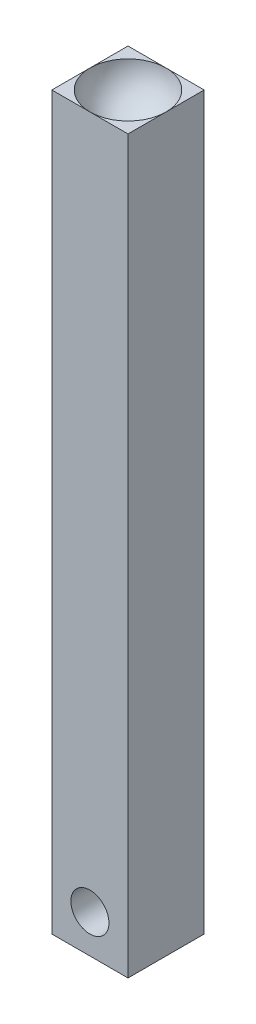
ISO-10303-21;
HEADER;
FILE_DESCRIPTION(('STEP AP214'),'2;1');
FILE_NAME('part.step','',(''),(''),'','','');
FILE_SCHEMA(('AUTOMOTIVE_DESIGN { 1 0 10303 214 1 1 1 1 }'));
ENDSEC;
DATA;
#1=APPLICATION_CONTEXT('core data for automotive mechanical design processes');
#2=APPLICATION_PROTOCOL_DEFINITION('international standard','automotive_design',2000,#1);
#3=PRODUCT_CONTEXT('',#1,'mechanical');
#4=PRODUCT('Part','Part','',(#3));
#5=PRODUCT_RELATED_PRODUCT_CATEGORY('part','',(#4));
#6=PRODUCT_DEFINITION_FORMATION('','',#4);
#7=PRODUCT_DEFINITION_CONTEXT('part definition',#1,'design');
#8=PRODUCT_DEFINITION('design','',#6,#7);
#9=PRODUCT_DEFINITION_SHAPE('','',#8);
#10=(LENGTH_UNIT() NAMED_UNIT(*) SI_UNIT(.MILLI.,.METRE.));
#11=(NAMED_UNIT(*) PLANE_ANGLE_UNIT() SI_UNIT($,.RADIAN.));
#12=(NAMED_UNIT(*) SI_UNIT($,.STERADIAN.) SOLID_ANGLE_UNIT());
#13=UNCERTAINTY_MEASURE_WITH_UNIT(LENGTH_MEASURE(1.E-05),#10,'distance_accuracy_value','');
#14=(GEOMETRIC_REPRESENTATION_CONTEXT(3) GLOBAL_UNCERTAINTY_ASSIGNED_CONTEXT((#13)) GLOBAL_UNIT_ASSIGNED_CONTEXT((#10,
#11,#12)) REPRESENTATION_CONTEXT('',''));
#15=CARTESIAN_POINT('',(0.,0.,0.));
#16=DIRECTION('',(0.,0.,1.));
#17=DIRECTION('',(1.,0.,0.));
#18=AXIS2_PLACEMENT_3D('',#15,#16,#17);
#19=CARTESIAN_POINT('',(0.,96.,0.));
#20=DIRECTION('',(0.,-1.,0.));
#21=DIRECTION('',(0.,0.,-1.));
#22=AXIS2_PLACEMENT_3D('',#19,#20,#21);
#23=PLANE('',#22);
#24=CARTESIAN_POINT('',(5.,96.,-5.));
#25=DIRECTION('',(0.,-1.,0.));
#26=DIRECTION('',(0.,0.,-1.));
#27=AXIS2_PLACEMENT_3D('',#24,#25,#26);
#28=CIRCLE('',#27,5.);
#29=CARTESIAN_POINT('',(5.,96.,-10.));
#30=VERTEX_POINT('',#29);
#31=CARTESIAN_POINT('',(0.,96.,-5.));
#32=VERTEX_POINT('',#31);
#33=EDGE_CURVE('E11',#30,#32,#28,.F.);
#34=ORIENTED_EDGE('',*,*,#33,.F.);
#35=DIRECTION('',(-1.,0.,0.));
#36=VECTOR('',#35,1.);
#37=CARTESIAN_POINT('',(0.,96.,-10.));
#38=LINE('',#37,#36);
#39=CARTESIAN_POINT('',(0.,96.,-10.));
#40=VERTEX_POINT('',#39);
#41=EDGE_CURVE('E60',#30,#40,#38,.T.);
#42=ORIENTED_EDGE('',*,*,#41,.T.);
#43=DIRECTION('',(0.,0.,1.));
#44=VECTOR('',#43,1.);
#45=CARTESIAN_POINT('',(0.,96.,0.));
#46=LINE('',#45,#44);
#47=EDGE_CURVE('E116',#40,#32,#46,.T.);
#48=ORIENTED_EDGE('',*,*,#47,.T.);
#49=EDGE_LOOP('',(#34,#42,#48));
#50=FACE_BOUND('',#49,.T.);
#51=ADVANCED_FACE('F34',(#50),#23,.F.);
#52=CARTESIAN_POINT('',(5.,96.,0.));
#53=VERTEX_POINT('',#52);
#54=EDGE_CURVE('E43',#32,#53,#28,.F.);
#55=ORIENTED_EDGE('',*,*,#54,.F.);
#56=CARTESIAN_POINT('',(0.,96.,0.));
#57=VERTEX_POINT('',#56);
#58=EDGE_CURVE('E90',#32,#57,#46,.T.);
#59=ORIENTED_EDGE('',*,*,#58,.T.);
#60=DIRECTION('',(1.,0.,0.));
#61=VECTOR('',#60,1.);
#62=CARTESIAN_POINT('',(0.,96.,0.));
#63=LINE('',#62,#61);
#64=EDGE_CURVE('E112',#57,#53,#63,.T.);
#65=ORIENTED_EDGE('',*,*,#64,.T.);
#66=EDGE_LOOP('',(#55,#59,#65));
#67=FACE_BOUND('',#66,.T.);
#68=ADVANCED_FACE('F118',(#67),#23,.F.);
#69=CARTESIAN_POINT('',(5.,96.,-5.));
#70=DIRECTION('',(0.,1.,0.));
#71=DIRECTION('',(0.,0.,1.));
#72=AXIS2_PLACEMENT_3D('',#69,#70,#71);
#73=CIRCLE('',#72,5.);
#74=CARTESIAN_POINT('',(10.,96.,-5.));
#75=VERTEX_POINT('',#74);
#76=EDGE_CURVE('E51',#53,#75,#73,.T.);
#77=ORIENTED_EDGE('',*,*,#76,.F.);
#78=CARTESIAN_POINT('',(10.,96.,0.));
#79=VERTEX_POINT('',#78);
#80=EDGE_CURVE('E103',#53,#79,#63,.T.);
#81=ORIENTED_EDGE('',*,*,#80,.T.);
#82=DIRECTION('',(0.,0.,-1.));
#83=VECTOR('',#82,1.);
#84=CARTESIAN_POINT('',(10.,96.,0.));
#85=LINE('',#84,#83);
#86=EDGE_CURVE('E106',#79,#75,#85,.T.);
#87=ORIENTED_EDGE('',*,*,#86,.T.);
#88=EDGE_LOOP('',(#77,#81,#87));
#89=FACE_BOUND('',#88,.T.);
#90=ADVANCED_FACE('F102',(#89),#23,.F.);
#91=CARTESIAN_POINT('',(0.,96.,0.));
#92=DIRECTION('',(1.,0.,0.));
#93=DIRECTION('',(0.,0.,-1.));
#94=AXIS2_PLACEMENT_3D('',#91,#92,#93);
#95=PLANE('',#94);
#96=DIRECTION('',(0.,0.,1.));
#97=VECTOR('',#96,1.);
#98=CARTESIAN_POINT('',(0.,0.,0.));
#99=LINE('',#98,#97);
#100=CARTESIAN_POINT('',(0.,0.,-10.));
#101=VERTEX_POINT('',#100);
#102=CARTESIAN_POINT('',(0.,0.,0.));
#103=VERTEX_POINT('',#102);
#104=EDGE_CURVE('E107',#101,#103,#99,.T.);
#105=ORIENTED_EDGE('',*,*,#104,.T.);
#106=DIRECTION('',(0.,-1.,0.));
#107=VECTOR('',#106,1.);
#108=CARTESIAN_POINT('',(0.,96.,0.));
#109=LINE('',#108,#107);
#110=EDGE_CURVE('E138',#57,#103,#109,.T.);
#111=ORIENTED_EDGE('',*,*,#110,.F.);
#112=ORIENTED_EDGE('',*,*,#58,.F.);
#113=ORIENTED_EDGE('',*,*,#47,.F.);
#114=DIRECTION('',(0.,-1.,0.));
#115=VECTOR('',#114,1.);
#116=CARTESIAN_POINT('',(0.,96.,-10.));
#117=LINE('',#116,#115);
#118=EDGE_CURVE('E126',#40,#101,#117,.T.);
#119=ORIENTED_EDGE('',*,*,#118,.T.);
#120=EDGE_LOOP('',(#105,#111,#112,#113,#119));
#121=FACE_BOUND('',#120,.T.);
#122=ADVANCED_FACE('F36',(#121),#95,.F.);
#123=CARTESIAN_POINT('',(0.,96.,0.));
#124=DIRECTION('',(0.,0.,-1.));
#125=DIRECTION('',(-1.,0.,0.));
#126=AXIS2_PLACEMENT_3D('',#123,#124,#125);
#127=PLANE('',#126);
#128=CARTESIAN_POINT('',(5.,5.,0.));
#129=DIRECTION('',(0.,0.,1.));
#130=DIRECTION('',(1.,0.,0.));
#131=AXIS2_PLACEMENT_3D('',#128,#129,#130);
#132=CIRCLE('',#131,2.5);
#133=CARTESIAN_POINT('',(7.5,5.,0.));
#134=VERTEX_POINT('',#133);
#135=EDGE_CURVE('E180',#134,#134,#132,.T.);
#136=ORIENTED_EDGE('',*,*,#135,.F.);
#137=EDGE_LOOP('',(#136));
#138=FACE_BOUND('',#137,.T.);
#139=DIRECTION('',(1.,0.,0.));
#140=VECTOR('',#139,1.);
#141=CARTESIAN_POINT('',(0.,0.,0.));
#142=LINE('',#141,#140);
#143=CARTESIAN_POINT('',(10.,0.,0.));
#144=VERTEX_POINT('',#143);
#145=EDGE_CURVE('E129',#103,#144,#142,.T.);
#146=ORIENTED_EDGE('',*,*,#145,.T.);
#147=DIRECTION('',(0.,-1.,0.));
#148=VECTOR('',#147,1.);
#149=CARTESIAN_POINT('',(10.,96.,0.));
#150=LINE('',#149,#148);
#151=EDGE_CURVE('E115',#79,#144,#150,.T.);
#152=ORIENTED_EDGE('',*,*,#151,.F.);
#153=ORIENTED_EDGE('',*,*,#80,.F.);
#154=ORIENTED_EDGE('',*,*,#64,.F.);
#155=ORIENTED_EDGE('',*,*,#110,.T.);
#156=EDGE_LOOP('',(#146,#152,#153,#154,#155));
#157=FACE_BOUND('',#156,.T.);
#158=ADVANCED_FACE('F110',(#138,#157),#127,.F.);
#159=CARTESIAN_POINT('',(10.,96.,0.));
#160=DIRECTION('',(-1.,0.,0.));
#161=DIRECTION('',(0.,0.,1.));
#162=AXIS2_PLACEMENT_3D('',#159,#160,#161);
#163=PLANE('',#162);
#164=DIRECTION('',(0.,0.,-1.));
#165=VECTOR('',#164,1.);
#166=CARTESIAN_POINT('',(10.,0.,0.));
#167=LINE('',#166,#165);
#168=CARTESIAN_POINT('',(9.99999999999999,0.,-10.));
#169=VERTEX_POINT('',#168);
#170=EDGE_CURVE('E131',#144,#169,#167,.T.);
#171=ORIENTED_EDGE('',*,*,#170,.T.);
#172=DIRECTION('',(0.,-1.,0.));
#173=VECTOR('',#172,1.);
#174=CARTESIAN_POINT('',(9.99999999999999,96.,-10.));
#175=LINE('',#174,#173);
#176=CARTESIAN_POINT('',(9.99999999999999,96.,-10.));
#177=VERTEX_POINT('',#176);
#178=EDGE_CURVE('E135',#177,#169,#175,.T.);
#179=ORIENTED_EDGE('',*,*,#178,.F.);
#180=EDGE_CURVE('E119',#75,#177,#85,.T.);
#181=ORIENTED_EDGE('',*,*,#180,.F.);
#182=ORIENTED_EDGE('',*,*,#86,.F.);
#183=ORIENTED_EDGE('',*,*,#151,.T.);
#184=EDGE_LOOP('',(#171,#179,#181,#182,#183));
#185=FACE_BOUND('',#184,.T.);
#186=ADVANCED_FACE('F147',(#185),#163,.F.);
#187=CARTESIAN_POINT('',(0.,96.,-10.));
#188=DIRECTION('',(0.,0.,1.));
#189=DIRECTION('',(1.,0.,0.));
#190=AXIS2_PLACEMENT_3D('',#187,#188,#189);
#191=PLANE('',#190);
#192=CARTESIAN_POINT('',(5.,5.,-10.));
#193=DIRECTION('',(0.,0.,1.));
#194=DIRECTION('',(1.,0.,0.));
#195=AXIS2_PLACEMENT_3D('',#192,#193,#194);
#196=CIRCLE('',#195,2.5);
#197=CARTESIAN_POINT('',(7.5,5.,-10.));
#198=VERTEX_POINT('',#197);
#199=EDGE_CURVE('E38',#198,#198,#196,.T.);
#200=ORIENTED_EDGE('',*,*,#199,.T.);
#201=EDGE_LOOP('',(#200));
#202=FACE_BOUND('',#201,.T.);
#203=DIRECTION('',(-1.,0.,0.));
#204=VECTOR('',#203,1.);
#205=CARTESIAN_POINT('',(0.,0.,-10.));
#206=LINE('',#205,#204);
#207=EDGE_CURVE('E82',#169,#101,#206,.T.);
#208=ORIENTED_EDGE('',*,*,#207,.T.);
#209=ORIENTED_EDGE('',*,*,#118,.F.);
#210=ORIENTED_EDGE('',*,*,#41,.F.);
#211=EDGE_CURVE('E123',#177,#30,#38,.T.);
#212=ORIENTED_EDGE('',*,*,#211,.F.);
#213=ORIENTED_EDGE('',*,*,#178,.T.);
#214=EDGE_LOOP('',(#208,#209,#210,#212,#213));
#215=FACE_BOUND('',#214,.T.);
#216=ADVANCED_FACE('F143',(#202,#215),#191,.F.);
#217=EDGE_CURVE('E44',#75,#30,#28,.F.);
#218=ORIENTED_EDGE('',*,*,#217,.F.);
#219=ORIENTED_EDGE('',*,*,#180,.T.);
#220=ORIENTED_EDGE('',*,*,#211,.T.);
#221=EDGE_LOOP('',(#218,#219,#220));
#222=FACE_BOUND('',#221,.T.);
#223=ADVANCED_FACE('F144',(#222),#23,.F.);
#224=CARTESIAN_POINT('',(0.,0.,0.));
#225=DIRECTION('',(0.,-1.,0.));
#226=DIRECTION('',(0.,0.,-1.));
#227=AXIS2_PLACEMENT_3D('',#224,#225,#226);
#228=PLANE('',#227);
#229=ORIENTED_EDGE('',*,*,#104,.F.);
#230=ORIENTED_EDGE('',*,*,#207,.F.);
#231=ORIENTED_EDGE('',*,*,#170,.F.);
#232=ORIENTED_EDGE('',*,*,#145,.F.);
#233=EDGE_LOOP('',(#229,#230,#231,#232));
#234=FACE_BOUND('',#233,.T.);
#235=ADVANCED_FACE('F151',(#234),#228,.T.);
#236=CARTESIAN_POINT('',(5.,96.,-5.));
#237=DIRECTION('',(0.,1.,0.));
#238=DIRECTION('',(-1.,0.,0.));
#239=AXIS2_PLACEMENT_3D('',#236,#237,#238);
#240=SPHERICAL_SURFACE('',#239,5.);
#241=ORIENTED_EDGE('',*,*,#76,.T.);
#242=ORIENTED_EDGE('',*,*,#217,.T.);
#243=ORIENTED_EDGE('',*,*,#33,.T.);
#244=ORIENTED_EDGE('',*,*,#54,.T.);
#245=EDGE_LOOP('',(#241,#242,#243,#244));
#246=FACE_BOUND('',#245,.T.);
#247=ADVANCED_FACE('F98',(#246),#240,.F.);
#248=CARTESIAN_POINT('',(5.,5.,-11.));
#249=DIRECTION('',(0.,0.,1.));
#250=DIRECTION('',(1.,0.,0.));
#251=AXIS2_PLACEMENT_3D('',#248,#249,#250);
#252=CYLINDRICAL_SURFACE('',#251,2.5);
#253=ORIENTED_EDGE('',*,*,#135,.T.);
#254=EDGE_LOOP('',(#253));
#255=FACE_BOUND('',#254,.T.);
#256=ORIENTED_EDGE('',*,*,#199,.F.);
#257=EDGE_LOOP('',(#256));
#258=FACE_BOUND('',#257,.T.);
#259=ADVANCED_FACE('F185',(#255,#258),#252,.F.);
#260=CLOSED_SHELL('',(#51,#68,#90,#122,#158,#186,#216,#223,#235,#247,#259));
#261=MANIFOLD_SOLID_BREP('B2',#260);
#262=ADVANCED_BREP_SHAPE_REPRESENTATION('',(#18,#261),#14);
#263=SHAPE_DEFINITION_REPRESENTATION(#9,#262);
ENDSEC;
END-ISO-10303-21;
